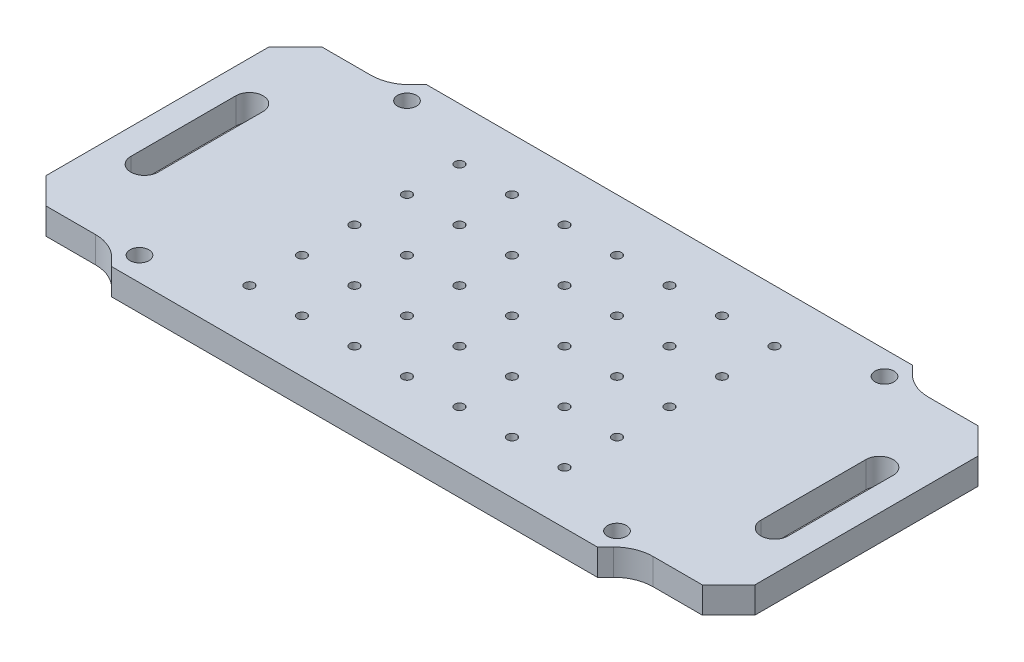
from build123d import *

# Parameters (mm, degrees)
SKETCH1_W                     = 127
SKETCH1_H                     = 76.2
BOSS_EXTRUDE1_DEPTH           = 3.175
CHAMFER1_SIZE                 = 4.7625
SKETCH7_R                     = 2.286
CUT_EXTRUDE1_DEPTH            = 75.324844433
MIRROR5_COPY_1_SKETCH_R       = 2.286
MIRROR5_COPY_1_DEPTH          = 75.324844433
BOSS_EXTRUDE4_DEPTH           = 6.35
FILLET1_R                     = 9.525
TAP_DRILL_FOR_4_40_TAP1_D     = 2.2606
TAP_DRILL_FOR_4_40_TAP1_DEPTH = 4.400847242
TAP_DRILL_FOR_4_40_TAP1_TIP   = 0.679152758


with BuildPart() as part:
    # Sketch1 → Boss-Extrude1 (new, symmetric)
    with BuildSketch(Plane(origin=(0, 0, 0), x_dir=(1, 0, 0), z_dir=(0, 1, 0))):
        Rectangle(SKETCH1_W, SKETCH1_H)
    extrude(amount=BOSS_EXTRUDE1_DEPTH, both=True)

    # Chamfer1
    chamfer1_edges = [part.edges().sort_by_distance(p)[0] for p in [
        (63.5, 0, 38.1),
        (-63.5, 0, 38.1),
        (-63.5, 0, -38.1),
        (63.5, 0, -38.1),
    ]]
    chamfer(chamfer1_edges, length=CHAMFER1_SIZE)

    # Sketch7 → Cut-Extrude1 (cut, symmetric)
    with BuildSketch(Plane(origin=(0, 3.175, 0), x_dir=(1, 0, 0), z_dir=(0, 1, 0))):
        with Locations(Location((-57.751153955, 32.351153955, 0), (0, 0, 270))):
            Circle(SKETCH7_R)
    cut_extrude1 = extrude(amount=CUT_EXTRUDE1_DEPTH, both=True, mode=Mode.SUBTRACT)

    # Mirror4: Cut-Extrude1 across plane
    add(cut_extrude1.mirror(Plane(origin=(0, 0, 0), x_dir=(0, 0, 1), z_dir=(1, 0, 0))), mode=Mode.SUBTRACT)

    # Mirror5: Cut-Extrude1 across plane
    add(cut_extrude1.mirror(Plane.XY), mode=Mode.SUBTRACT)

    # Mirror5 copy 1 sketch → Mirror5 copy 1 (cut, symmetric)
    with BuildSketch(Plane(origin=(0, 3.175, 0), x_dir=(-1, 0, 0), z_dir=(0, 1, 0))):
        with Locations(Location((-57.751153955, 32.351153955, 0), (0, 0, 270))):
            Circle(MIRROR5_COPY_1_SKETCH_R)
    extrude(amount=MIRROR5_COPY_1_DEPTH, both=True, mode=Mode.SUBTRACT)

    # Sketch12 → Boss-Extrude4 (add)
    # profile 1 of 2: a face of its own
    with BuildSketch(Plane(origin=(0, 3.175, 0), x_dir=(1, 0, 0), z_dir=(0, 1, 0))):
        Polygon((-63.5, -33.3375), (-63.5, 33.3375), (-79.375, 33.3375), (-85.725, 26.9875), (-85.725, -26.9875), (-79.375, -33.3375), align=None)
        with BuildLine():
            Line((-79.502, -12.7), (-79.502, 12.7))
            ThreePointArc((-79.502, 12.7), (-76.2, 16.002), (-72.898, 12.7))
            Line((-72.898, 12.7), (-72.898, -12.7))
            ThreePointArc((-72.898, -12.7), (-76.2, -16.002), (-79.502, -12.7))
        make_face(mode=Mode.SUBTRACT)
    # profile 2 of 2: a face of its own
    with BuildSketch(Plane(origin=(0, 3.175, 0), x_dir=(1, 0, 0), z_dir=(0, 1, 0))):
        Polygon((79.375, -33.3375), (85.725, -26.9875), (85.725, 26.9875), (79.375, 33.3375), (63.5, 33.3375), (63.5, -33.3375), align=None)
        with BuildLine():
            Line((72.898, -12.7), (72.898, 12.7))
            ThreePointArc((72.898, 12.7), (76.2, 16.002), (79.502, 12.7))
            Line((79.502, 12.7), (79.502, -12.7))
            ThreePointArc((79.502, -12.7), (76.2, -16.002), (72.898, -12.7))
        make_face(mode=Mode.SUBTRACT)
    extrude(amount=-BOSS_EXTRUDE4_DEPTH)

    # Fillet1
    fillet1_edges = [part.edges().sort_by_distance(p)[0] for p in [
        (-63.5, 0, 33.3375),
        (-63.5, 0, -33.3375),
        (63.5, 0, 33.3375),
        (63.5, 0, -33.3375),
    ]]
    fillet(fillet1_edges, radius=FILLET1_R)

    # Tap Drill for _4-40 Tap1
    with Locations(Plane(origin=(-38.1, 3.175, -25.4), x_dir=(0, 0, 1), z_dir=(0, 1, 0))):
        with Locations((0, 0), (0, 12.7), (12.7, 12.7), (12.7, 0), (25.4, 0), (25.4, 12.7), (38.1, 12.7), (38.1, 0), (50.8, 0), (50.8, 12.7), (50.8, 25.4), (38.1, 25.4), (25.4, 25.4), (12.7, 25.4), (0, 25.4), (0, 38.1), (12.7, 38.1), (38.1, 38.1), (25.4, 38.1), (50.8, 38.1), (50.8, 50.8), (38.1, 50.8), (25.4, 50.8), (12.7, 50.8), (0, 50.8), (0, 63.5), (12.7, 63.5), (25.4, 63.5), (38.1, 63.5), (50.8, 63.5), (50.8, 76.2), (38.1, 76.2), (25.4, 76.2), (12.7, 76.2), (0, 76.2)):
            Hole(TAP_DRILL_FOR_4_40_TAP1_D / 2, depth=TAP_DRILL_FOR_4_40_TAP1_DEPTH)
            with Locations((0, 0, -(TAP_DRILL_FOR_4_40_TAP1_DEPTH + TAP_DRILL_FOR_4_40_TAP1_TIP / 2))):  # 118° drill point
                Cone(0, TAP_DRILL_FOR_4_40_TAP1_D / 2, TAP_DRILL_FOR_4_40_TAP1_TIP, mode=Mode.SUBTRACT)


solid = part.part
